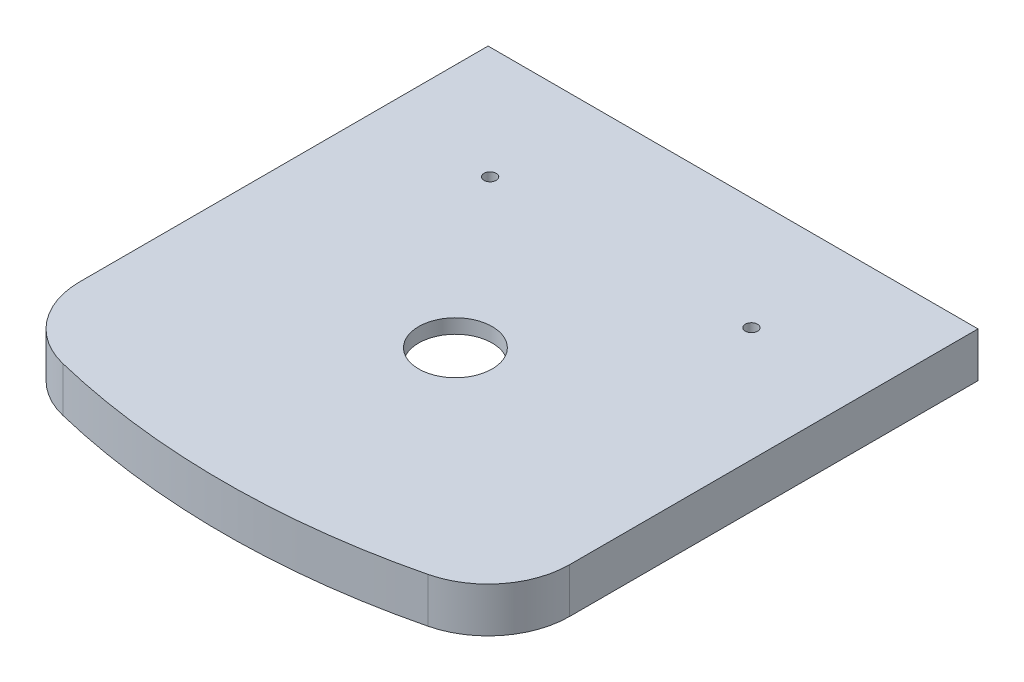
from build123d import *

# Parameters (mm, degrees)
EXTRUSION1_DEPTH        = 11
COQUE1_T                = -3.5
ESQUISSE3_R             = 5
ESQUISSE3_R_2           = 1.5
EXTRUSION2_DEPTH        = 9.5
ESQUISSE4_R             = 1.5
ENL_V_MAT_EXTRU_1_DEPTH = 170.97132111
ESQUISSE5_R             = 9
ENL_V_MAT_EXTRU_2_DEPTH = 171.202820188
ESQUISSE6_R             = 19
EXTRUSION5_DEPTH        = 7
ESQUISSE7_R             = 1.5
ENL_V_MAT_EXTRU_3_DEPTH = 5


with BuildPart() as part:
    # Esquisse1 → Extrusion1 (new body)
    with BuildSketch(Plane(origin=(0, 0, 0), x_dir=(1, 0, 0), z_dir=(0, 1, 0))):
        with BuildLine():
            Line((0, 20), (0, 120))
            Line((0, 120), (120, 120))
            Line((120, 120), (120, 20))
            ThreePointArc((120, 20), (115.732703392, 7.651638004), (104.751795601, 0.572688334))
            ThreePointArc((104.751795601, 0.572688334), (60, -4.820816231), (15.248204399, 0.572688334))
            ThreePointArc((15.248204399, 0.572688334), (4.267296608, 7.651638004), (0, 20))
        make_face()
    extrude(amount=EXTRUSION1_DEPTH)

    # Coque1
    coque1_openings = [part.faces().sort_by_distance(p)[0] for p in [
        (60, 0, -59.4903298),
    ]]
    offset(amount=COQUE1_T, openings=coque1_openings, kind=Kind.INTERSECTION)

    # Esquisse3 → Extrusion2 (add)
    # profile 1 of 4: a face of its own
    with BuildSketch(Plane.XZ.offset(-7.5)):
        with Locations(Location((87.5, -99, 0), (0, 0, 270))):
            Circle(ESQUISSE3_R)
        with Locations(Location((87.5, -99, 0), (0, 0, 270))):
            Circle(ESQUISSE3_R_2, mode=Mode.SUBTRACT)
    # profile 2 of 4: a face of its own
    with BuildSketch(Plane.XZ.offset(-7.5)):
        with Locations(Location((87.5, -69, 0), (0, 0, 270))):
            Circle(ESQUISSE3_R)
        with Locations(Location((87.5, -69, 0), (0, 0, 270))):
            Circle(ESQUISSE3_R_2, mode=Mode.SUBTRACT)
    # profile 3 of 4: a face of its own
    with BuildSketch(Plane.XZ.offset(-7.5)):
        with Locations(Location((32.5, -69, 0), (0, 0, 90))):
            Circle(ESQUISSE3_R)
        with Locations(Location((32.5, -69, 0), (0, 0, 90))):
            Circle(ESQUISSE3_R_2, mode=Mode.SUBTRACT)
    # profile 4 of 4: a face of its own
    with BuildSketch(Plane.XZ.offset(-7.5)):
        with Locations(Location((32.5, -99, 0), (0, 0, 90))):
            Circle(ESQUISSE3_R)
        with Locations(Location((32.5, -99, 0), (0, 0, 90))):
            Circle(ESQUISSE3_R_2, mode=Mode.SUBTRACT)
    extrude(amount=EXTRUSION2_DEPTH)

    # Esquisse4 → Enl_v. mat.-Extru.1 (cut, through all)
    with BuildSketch(Plane.XZ.offset(-7.5)):
        with Locations(Location((92, -92.5, 0), (0, 0, 270))):
            Circle(ESQUISSE4_R)
        with Locations(Location((28, -92.5, 0), (0, 0, 270))):
            Circle(ESQUISSE4_R)
    extrude(amount=-ENL_V_MAT_EXTRU_1_DEPTH, mode=Mode.SUBTRACT)

    # Esquisse5 → Enl_v. mat.-Extru.2 (cut, through all)
    with BuildSketch(Plane(origin=(0, 11, 0), x_dir=(-1, 0, 0), z_dir=(0, 1, 0))):
        with Locations(Location((-60, -52, 0), (0, 0, 90))):
            Circle(ESQUISSE5_R)
    extrude(amount=-ENL_V_MAT_EXTRU_2_DEPTH, mode=Mode.SUBTRACT)

    # Esquisse6 → Extrusion5 (add)
    with BuildSketch(Plane.XZ.offset(-7.5)):
        with BuildLine():
            Line((116.5, -50.2), (116.5, -53.8))
            Line((116.5, -53.8), (81.5, -53.8))
            ThreePointArc((81.5, -53.8), (79.590681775, -60.883150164), (75.520710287, -66.986579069))
            Line((75.520710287, -66.986579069), (116.5, -113.768246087))
            Line((116.5, -113.768246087), (116.5, -116.5))
            Line((116.5, -116.5), (114.107068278, -116.5))
            Line((114.107068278, -116.5), (72.812734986, -69.358681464))
            ThreePointArc((72.812734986, -69.358681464), (67.60180912, -72.214989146), (61.8, -73.5))
            Line((61.8, -73.5), (61.8, -116.5))
            Line((61.8, -116.5), (58.2, -116.5))
            Line((58.2, -116.5), (58.2, -73.5))
            ThreePointArc((58.2, -73.5), (52.432356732, -72.124134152), (47.187265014, -69.358681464))
            Line((47.187265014, -69.358681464), (5.892931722, -116.5))
            Line((5.892931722, -116.5), (3.5, -116.5))
            Line((3.5, -116.5), (3.5, -113.768246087))
            Line((3.5, -113.768246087), (44.479289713, -66.986579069))
            ThreePointArc((44.479289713, -66.986579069), (40.282330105, -60.940731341), (38.5, -53.8))
            Line((38.5, -53.8), (3.5, -53.8))
            Line((3.5, -53.8), (3.5, -50.2))
            Line((3.5, -50.2), (38.5, -50.2))
            ThreePointArc((38.5, -50.2), (39.656354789, -44.889664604), (42.05971349, -40.01517126))
            Line((42.05971349, -40.01517126), (5.89925093, -11.220705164))
            ThreePointArc((5.89925093, -11.220705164), (6.88949437, -9.708266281), (8.141788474, -8.404497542))
            Line((8.141788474, -8.404497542), (44.302251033, -37.198963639))
            ThreePointArc((44.302251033, -37.198963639), (50.618445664, -32.536916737), (58.2, -30.5))
            Line((58.2, -30.5), (58.2, 1.320816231))
            ThreePointArc((58.2, 1.320816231), (60, 1.277016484), (61.8, 1.320816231))
            Line((61.8, 1.320816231), (61.8, -30.5))
            ThreePointArc((61.8, -30.5), (69.396257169, -32.572522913), (75.715332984, -37.270155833))
            Line((75.715332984, -37.270155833), (111.196832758, -7.827656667))
            ThreePointArc((111.196832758, -7.827656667), (112.647342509, -9.284025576), (113.880330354, -10.928631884))
            Line((113.880330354, -10.928631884), (78.301309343, -40.386459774))
            ThreePointArc((78.301309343, -40.386459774), (80.47304716, -45.106660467), (81.5, -50.2))
            Line((81.5, -50.2), (116.5, -50.2))
        make_face()
        with Locations(Location((60, -52, 0), (0, 0, 270))):
            Circle(ESQUISSE6_R, mode=Mode.SUBTRACT)
    extrude(amount=EXTRUSION5_DEPTH)

    # Esquisse7 → Enl_v. mat.-Extru.3 (cut)
    with BuildSketch(Plane.XZ.offset(-0.5)):
        with Locations(Location((60, -80, 0), (0, 0, 270))):
            Circle(ESQUISSE7_R)
        with Locations(Location((38.096101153, -34.558118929, 0), (0, 0, 270))):
            Circle(ESQUISSE7_R)
        with Locations(Location((81.903898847, -34.558118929, 0), (0, 0, 270))):
            Circle(ESQUISSE7_R)
    extrude(amount=-ENL_V_MAT_EXTRU_3_DEPTH, mode=Mode.SUBTRACT)


solid = part.part
